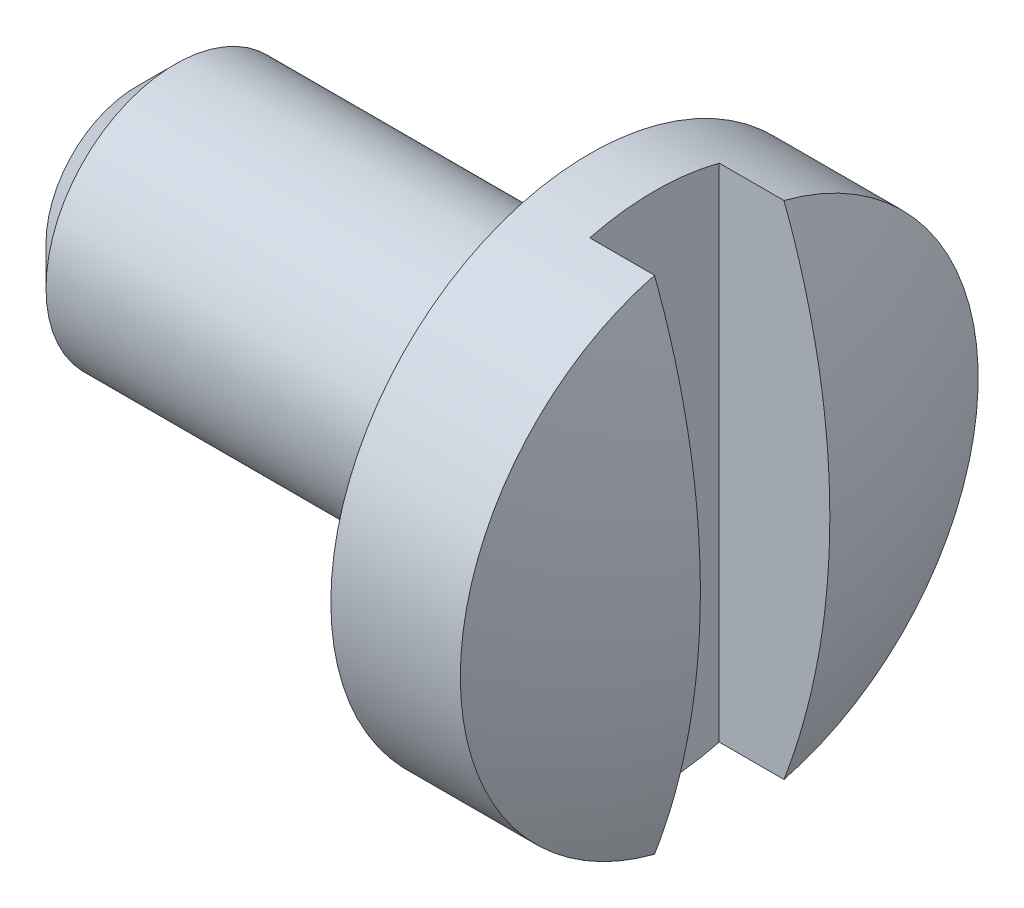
ISO-10303-21;
HEADER;
FILE_DESCRIPTION(('STEP AP214'),'2;1');
FILE_NAME('part.step','',(''),(''),'','','');
FILE_SCHEMA(('AUTOMOTIVE_DESIGN { 1 0 10303 214 1 1 1 1 }'));
ENDSEC;
DATA;
#1=APPLICATION_CONTEXT('core data for automotive mechanical design processes');
#2=APPLICATION_PROTOCOL_DEFINITION('international standard','automotive_design',2000,#1);
#3=PRODUCT_CONTEXT('',#1,'mechanical');
#4=PRODUCT('Part','Part','',(#3));
#5=PRODUCT_RELATED_PRODUCT_CATEGORY('part','',(#4));
#6=PRODUCT_DEFINITION_FORMATION('','',#4);
#7=PRODUCT_DEFINITION_CONTEXT('part definition',#1,'design');
#8=PRODUCT_DEFINITION('design','',#6,#7);
#9=PRODUCT_DEFINITION_SHAPE('','',#8);
#10=(LENGTH_UNIT() NAMED_UNIT(*) SI_UNIT(.MILLI.,.METRE.));
#11=(NAMED_UNIT(*) PLANE_ANGLE_UNIT() SI_UNIT($,.RADIAN.));
#12=(NAMED_UNIT(*) SI_UNIT($,.STERADIAN.) SOLID_ANGLE_UNIT());
#13=UNCERTAINTY_MEASURE_WITH_UNIT(LENGTH_MEASURE(1.E-05),#10,'distance_accuracy_value','');
#14=(GEOMETRIC_REPRESENTATION_CONTEXT(3) GLOBAL_UNCERTAINTY_ASSIGNED_CONTEXT((#13)) GLOBAL_UNIT_ASSIGNED_CONTEXT((#10,
#11,#12)) REPRESENTATION_CONTEXT('',''));
#15=CARTESIAN_POINT('',(0.,0.,0.));
#16=DIRECTION('',(0.,0.,1.));
#17=DIRECTION('',(1.,0.,0.));
#18=AXIS2_PLACEMENT_3D('',#15,#16,#17);
#19=CARTESIAN_POINT('',(-3.96360076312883,0.,0.));
#20=DIRECTION('',(-1.,0.,0.));
#21=DIRECTION('',(0.,0.,1.));
#22=AXIS2_PLACEMENT_3D('',#19,#20,#21);
#23=CYLINDRICAL_SURFACE('',#22,2.);
#24=CARTESIAN_POINT('',(1.,0.,0.));
#25=DIRECTION('',(-1.,0.,0.));
#26=DIRECTION('',(0.,0.,1.));
#27=AXIS2_PLACEMENT_3D('',#24,#25,#26);
#28=CIRCLE('',#27,2.);
#29=CARTESIAN_POINT('',(1.,0.,2.));
#30=VERTEX_POINT('',#29);
#31=EDGE_CURVE('E100',#30,#30,#28,.T.);
#32=ORIENTED_EDGE('',*,*,#31,.F.);
#33=EDGE_LOOP('',(#32));
#34=FACE_BOUND('',#33,.T.);
#35=DIRECTION('',(-1.,0.,0.));
#36=VECTOR('',#35,1.);
#37=CARTESIAN_POINT('',(-3.96360076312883,1.93649167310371,0.5));
#38=LINE('',#37,#36);
#39=CARTESIAN_POINT('',(1.5,1.93649167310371,0.5));
#40=VERTEX_POINT('',#39);
#41=CARTESIAN_POINT('',(2.,1.93649167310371,0.5));
#42=VERTEX_POINT('',#41);
#43=EDGE_CURVE('E90',#40,#42,#38,.F.);
#44=ORIENTED_EDGE('',*,*,#43,.F.);
#45=CARTESIAN_POINT('',(1.5,0.,0.));
#46=DIRECTION('',(1.,0.,0.));
#47=DIRECTION('',(0.,0.,-1.));
#48=AXIS2_PLACEMENT_3D('',#45,#46,#47);
#49=CIRCLE('',#48,2.);
#50=CARTESIAN_POINT('',(1.5,1.93649167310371,-0.5));
#51=VERTEX_POINT('',#50);
#52=EDGE_CURVE('E11',#51,#40,#49,.T.);
#53=ORIENTED_EDGE('',*,*,#52,.F.);
#54=DIRECTION('',(-1.,0.,0.));
#55=VECTOR('',#54,1.);
#56=CARTESIAN_POINT('',(-3.96360076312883,1.93649167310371,-0.5));
#57=LINE('',#56,#55);
#58=CARTESIAN_POINT('',(2.,1.93649167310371,-0.5));
#59=VERTEX_POINT('',#58);
#60=EDGE_CURVE('E83',#59,#51,#57,.T.);
#61=ORIENTED_EDGE('',*,*,#60,.F.);
#62=CARTESIAN_POINT('',(2.,0.,0.));
#63=DIRECTION('',(-1.,0.,0.));
#64=DIRECTION('',(0.,0.,1.));
#65=AXIS2_PLACEMENT_3D('',#62,#63,#64);
#66=CIRCLE('',#65,2.);
#67=CARTESIAN_POINT('',(2.,-1.93649167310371,-0.5));
#68=VERTEX_POINT('',#67);
#69=EDGE_CURVE('E88',#59,#68,#66,.T.);
#70=ORIENTED_EDGE('',*,*,#69,.T.);
#71=DIRECTION('',(-1.,0.,0.));
#72=VECTOR('',#71,1.);
#73=CARTESIAN_POINT('',(-3.96360076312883,-1.93649167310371,-0.5));
#74=LINE('',#73,#72);
#75=CARTESIAN_POINT('',(1.5,-1.93649167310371,-0.5));
#76=VERTEX_POINT('',#75);
#77=EDGE_CURVE('E48',#76,#68,#74,.F.);
#78=ORIENTED_EDGE('',*,*,#77,.F.);
#79=CARTESIAN_POINT('',(1.5,-1.93649167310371,0.5));
#80=VERTEX_POINT('',#79);
#81=EDGE_CURVE('E37',#80,#76,#49,.T.);
#82=ORIENTED_EDGE('',*,*,#81,.F.);
#83=DIRECTION('',(-1.,0.,0.));
#84=VECTOR('',#83,1.);
#85=CARTESIAN_POINT('',(-3.96360076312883,-1.93649167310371,0.5));
#86=LINE('',#85,#84);
#87=CARTESIAN_POINT('',(2.,-1.93649167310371,0.5));
#88=VERTEX_POINT('',#87);
#89=EDGE_CURVE('E95',#88,#80,#86,.T.);
#90=ORIENTED_EDGE('',*,*,#89,.F.);
#91=EDGE_CURVE('E97',#88,#42,#66,.T.);
#92=ORIENTED_EDGE('',*,*,#91,.T.);
#93=EDGE_LOOP('',(#44,#53,#61,#70,#78,#82,#90,#92));
#94=FACE_BOUND('',#93,.T.);
#95=ADVANCED_FACE('F33',(#34,#94),#23,.T.);
#96=CARTESIAN_POINT('',(-3.1234753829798,0.,0.));
#97=DIRECTION('',(-1.,0.,0.));
#98=DIRECTION('',(0.,1.,0.));
#99=AXIS2_PLACEMENT_3D('',#96,#97,#98);
#100=SPHERICAL_SURFACE('',#99,5.5);
#101=CARTESIAN_POINT('',(-3.1234753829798,0.,0.5));
#102=DIRECTION('',(0.,0.,-1.));
#103=DIRECTION('',(0.,1.,0.));
#104=AXIS2_PLACEMENT_3D('',#101,#102,#103);
#105=CIRCLE('',#104,5.47722557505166);
#106=EDGE_CURVE('E56',#42,#88,#105,.T.);
#107=ORIENTED_EDGE('',*,*,#106,.F.);
#108=ORIENTED_EDGE('',*,*,#91,.F.);
#109=EDGE_LOOP('',(#107,#108));
#110=FACE_BOUND('',#109,.T.);
#111=ADVANCED_FACE('F116',(#110),#100,.T.);
#112=CARTESIAN_POINT('',(-3.1234753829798,0.,-0.5));
#113=DIRECTION('',(0.,0.,1.));
#114=DIRECTION('',(0.,-1.,0.));
#115=AXIS2_PLACEMENT_3D('',#112,#113,#114);
#116=CIRCLE('',#115,5.47722557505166);
#117=EDGE_CURVE('E112',#68,#59,#116,.T.);
#118=ORIENTED_EDGE('',*,*,#117,.F.);
#119=ORIENTED_EDGE('',*,*,#69,.F.);
#120=EDGE_LOOP('',(#118,#119));
#121=FACE_BOUND('',#120,.T.);
#122=ADVANCED_FACE('F114',(#121),#100,.T.);
#123=CARTESIAN_POINT('',(-2.5,0.,0.));
#124=DIRECTION('',(1.,0.,0.));
#125=DIRECTION('',(0.,0.,-1.));
#126=AXIS2_PLACEMENT_3D('',#123,#124,#125);
#127=PLANE('',#126);
#128=CARTESIAN_POINT('',(-2.5,0.,0.));
#129=DIRECTION('',(-1.,0.,0.));
#130=DIRECTION('',(0.,0.,1.));
#131=AXIS2_PLACEMENT_3D('',#128,#129,#130);
#132=CIRCLE('',#131,0.7);
#133=CARTESIAN_POINT('',(-2.5,0.,0.7));
#134=VERTEX_POINT('',#133);
#135=EDGE_CURVE('E109',#134,#134,#132,.T.);
#136=ORIENTED_EDGE('',*,*,#135,.T.);
#137=EDGE_LOOP('',(#136));
#138=FACE_BOUND('',#137,.T.);
#139=ADVANCED_FACE('F35',(#138),#127,.F.);
#140=CARTESIAN_POINT('',(-2.20000000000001,0.,0.));
#141=DIRECTION('',(1.,0.,0.));
#142=DIRECTION('',(0.,0.,-1.));
#143=AXIS2_PLACEMENT_3D('',#140,#141,#142);
#144=CONICAL_SURFACE('',#143,0.999999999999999,0.785398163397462);
#145=ORIENTED_EDGE('',*,*,#135,.F.);
#146=EDGE_LOOP('',(#145));
#147=FACE_BOUND('',#146,.T.);
#148=CARTESIAN_POINT('',(-2.20000000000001,0.,0.));
#149=DIRECTION('',(-1.,0.,0.));
#150=DIRECTION('',(0.,0.,1.));
#151=AXIS2_PLACEMENT_3D('',#148,#149,#150);
#152=CIRCLE('',#151,0.999999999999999);
#153=CARTESIAN_POINT('',(-2.20000000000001,0.,0.999999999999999));
#154=VERTEX_POINT('',#153);
#155=EDGE_CURVE('E106',#154,#154,#152,.T.);
#156=ORIENTED_EDGE('',*,*,#155,.T.);
#157=EDGE_LOOP('',(#156));
#158=FACE_BOUND('',#157,.T.);
#159=ADVANCED_FACE('F122',(#147,#158),#144,.T.);
#160=CARTESIAN_POINT('',(-3.96360076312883,0.,0.));
#161=DIRECTION('',(-1.,0.,0.));
#162=DIRECTION('',(0.,0.,1.));
#163=AXIS2_PLACEMENT_3D('',#160,#161,#162);
#164=CYLINDRICAL_SURFACE('',#163,1.);
#165=ORIENTED_EDGE('',*,*,#155,.F.);
#166=EDGE_LOOP('',(#165));
#167=FACE_BOUND('',#166,.T.);
#168=CARTESIAN_POINT('',(1.,0.,0.));
#169=DIRECTION('',(-1.,0.,0.));
#170=DIRECTION('',(0.,0.,1.));
#171=AXIS2_PLACEMENT_3D('',#168,#169,#170);
#172=CIRCLE('',#171,1.);
#173=CARTESIAN_POINT('',(1.,0.,1.));
#174=VERTEX_POINT('',#173);
#175=EDGE_CURVE('E103',#174,#174,#172,.T.);
#176=ORIENTED_EDGE('',*,*,#175,.T.);
#177=EDGE_LOOP('',(#176));
#178=FACE_BOUND('',#177,.T.);
#179=ADVANCED_FACE('F136',(#167,#178),#164,.T.);
#180=CARTESIAN_POINT('',(1.,1.,0.));
#181=DIRECTION('',(1.,0.,0.));
#182=DIRECTION('',(0.,0.,-1.));
#183=AXIS2_PLACEMENT_3D('',#180,#181,#182);
#184=PLANE('',#183);
#185=ORIENTED_EDGE('',*,*,#175,.F.);
#186=EDGE_LOOP('',(#185));
#187=FACE_BOUND('',#186,.T.);
#188=ORIENTED_EDGE('',*,*,#31,.T.);
#189=EDGE_LOOP('',(#188));
#190=FACE_BOUND('',#189,.T.);
#191=ADVANCED_FACE('F133',(#187,#190),#184,.F.);
#192=CARTESIAN_POINT('',(1.5,0.,0.));
#193=DIRECTION('',(1.,0.,0.));
#194=DIRECTION('',(0.,0.,-1.));
#195=AXIS2_PLACEMENT_3D('',#192,#193,#194);
#196=PLANE('',#195);
#197=ORIENTED_EDGE('',*,*,#52,.T.);
#198=DIRECTION('',(0.,-1.,0.));
#199=VECTOR('',#198,1.);
#200=CARTESIAN_POINT('',(1.5,2.5,0.5));
#201=LINE('',#200,#199);
#202=EDGE_CURVE('E79',#40,#80,#201,.T.);
#203=ORIENTED_EDGE('',*,*,#202,.T.);
#204=ORIENTED_EDGE('',*,*,#81,.T.);
#205=DIRECTION('',(0.,1.,0.));
#206=VECTOR('',#205,1.);
#207=CARTESIAN_POINT('',(1.5,2.5,-0.5));
#208=LINE('',#207,#206);
#209=EDGE_CURVE('E76',#76,#51,#208,.T.);
#210=ORIENTED_EDGE('',*,*,#209,.T.);
#211=EDGE_LOOP('',(#197,#203,#204,#210));
#212=FACE_BOUND('',#211,.T.);
#213=ADVANCED_FACE('F75',(#212),#196,.T.);
#214=CARTESIAN_POINT('',(2.3765246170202,2.5,0.5));
#215=DIRECTION('',(0.,0.,-1.));
#216=DIRECTION('',(0.,1.,0.));
#217=AXIS2_PLACEMENT_3D('',#214,#215,#216);
#218=PLANE('',#217);
#219=ORIENTED_EDGE('',*,*,#89,.T.);
#220=ORIENTED_EDGE('',*,*,#202,.F.);
#221=ORIENTED_EDGE('',*,*,#43,.T.);
#222=ORIENTED_EDGE('',*,*,#106,.T.);
#223=EDGE_LOOP('',(#219,#220,#221,#222));
#224=FACE_BOUND('',#223,.T.);
#225=ADVANCED_FACE('F166',(#224),#218,.T.);
#226=CARTESIAN_POINT('',(2.3765246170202,2.5,-0.5));
#227=DIRECTION('',(0.,0.,1.));
#228=DIRECTION('',(0.,-1.,0.));
#229=AXIS2_PLACEMENT_3D('',#226,#227,#228);
#230=PLANE('',#229);
#231=ORIENTED_EDGE('',*,*,#60,.T.);
#232=ORIENTED_EDGE('',*,*,#209,.F.);
#233=ORIENTED_EDGE('',*,*,#77,.T.);
#234=ORIENTED_EDGE('',*,*,#117,.T.);
#235=EDGE_LOOP('',(#231,#232,#233,#234));
#236=FACE_BOUND('',#235,.T.);
#237=ADVANCED_FACE('F81',(#236),#230,.T.);
#238=CLOSED_SHELL('',(#95,#111,#122,#139,#159,#179,#191,#213,#225,#237));
#239=MANIFOLD_SOLID_BREP('B2',#238);
#240=ADVANCED_BREP_SHAPE_REPRESENTATION('',(#18,#239),#14);
#241=SHAPE_DEFINITION_REPRESENTATION(#9,#240);
ENDSEC;
END-ISO-10303-21;
